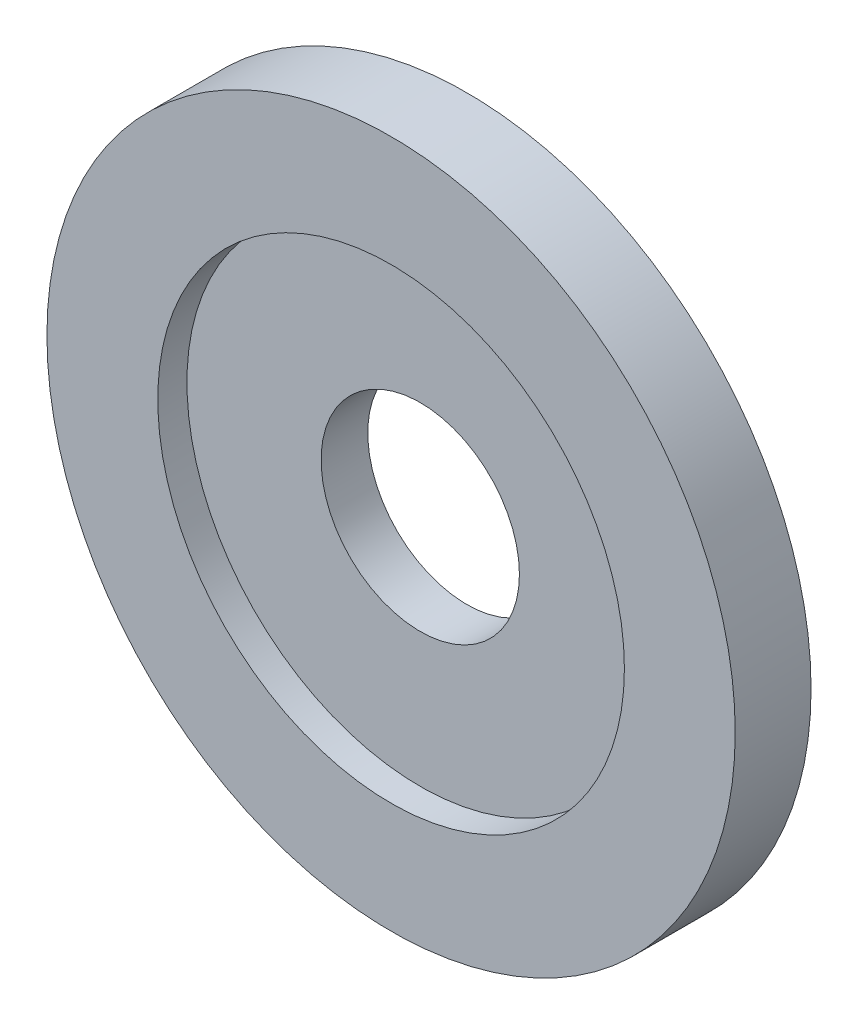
from build123d import *

# Parameters (mm, degrees)
ESQUISSE1_R          = 29.5
EXTRUSION1_DEPTH     = 6.5
PER_AGE1_D           = 17
PER_AGE1_DEPTH       = 15
PER_AGE1_CBORE_D     = 40
PER_AGE1_CBORE_DEPTH = 2.5


with BuildPart() as part:
    # Esquisse1 → Extrusion1 (new body)
    with BuildSketch(Plane.XY):
        with Locations(Location((0, 0, 0), (0, 0, 180))):
            Circle(ESQUISSE1_R)
    extrude(amount=EXTRUSION1_DEPTH)

    # Per_age1
    with Locations(Plane.XY.offset(6.5)):
        with Locations((0, 0)):
            CounterBoreHole(PER_AGE1_D / 2, PER_AGE1_CBORE_D / 2, PER_AGE1_CBORE_DEPTH, depth=PER_AGE1_DEPTH)


solid = part.part
